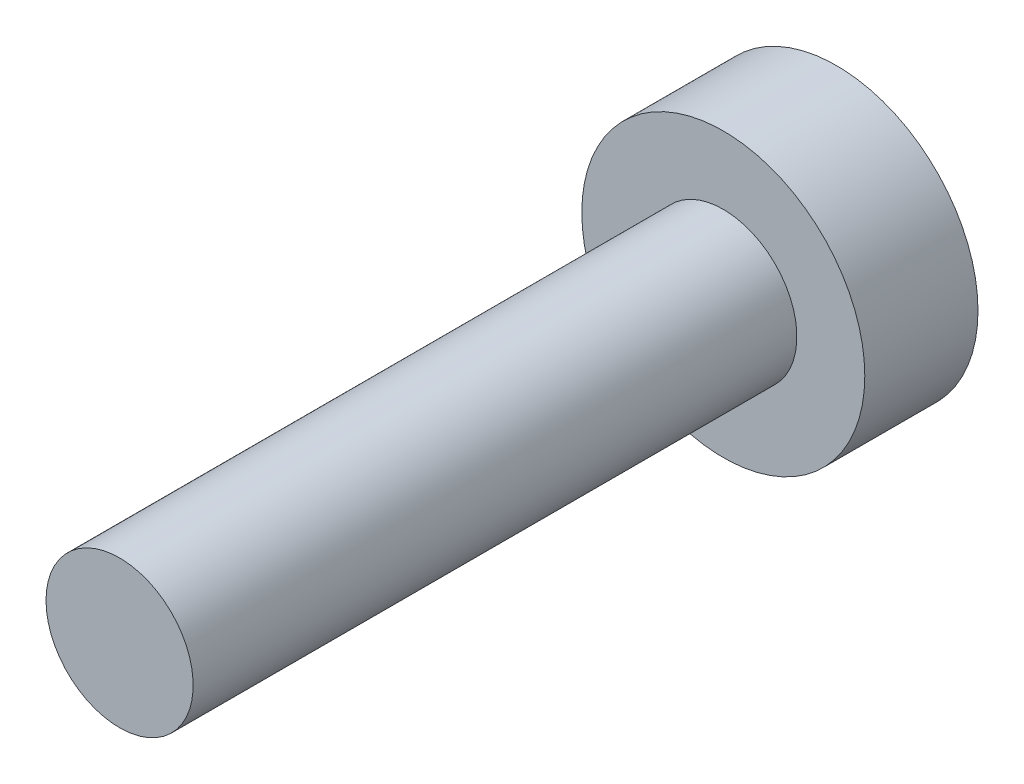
ISO-10303-21;
HEADER;
FILE_DESCRIPTION(('STEP AP214'),'2;1');
FILE_NAME('part.step','',(''),(''),'','','');
FILE_SCHEMA(('AUTOMOTIVE_DESIGN { 1 0 10303 214 1 1 1 1 }'));
ENDSEC;
DATA;
#1=APPLICATION_CONTEXT('core data for automotive mechanical design processes');
#2=APPLICATION_PROTOCOL_DEFINITION('international standard','automotive_design',2000,#1);
#3=PRODUCT_CONTEXT('',#1,'mechanical');
#4=PRODUCT('Part','Part','',(#3));
#5=PRODUCT_RELATED_PRODUCT_CATEGORY('part','',(#4));
#6=PRODUCT_DEFINITION_FORMATION('','',#4);
#7=PRODUCT_DEFINITION_CONTEXT('part definition',#1,'design');
#8=PRODUCT_DEFINITION('design','',#6,#7);
#9=PRODUCT_DEFINITION_SHAPE('','',#8);
#10=(LENGTH_UNIT() NAMED_UNIT(*) SI_UNIT(.MILLI.,.METRE.));
#11=(NAMED_UNIT(*) PLANE_ANGLE_UNIT() SI_UNIT($,.RADIAN.));
#12=(NAMED_UNIT(*) SI_UNIT($,.STERADIAN.) SOLID_ANGLE_UNIT());
#13=UNCERTAINTY_MEASURE_WITH_UNIT(LENGTH_MEASURE(1.E-05),#10,'distance_accuracy_value','');
#14=(GEOMETRIC_REPRESENTATION_CONTEXT(3) GLOBAL_UNCERTAINTY_ASSIGNED_CONTEXT((#13)) GLOBAL_UNIT_ASSIGNED_CONTEXT((#10,
#11,#12)) REPRESENTATION_CONTEXT('',''));
#15=CARTESIAN_POINT('',(0.,0.,0.));
#16=DIRECTION('',(0.,0.,1.));
#17=DIRECTION('',(1.,0.,0.));
#18=AXIS2_PLACEMENT_3D('',#15,#16,#17);
#19=CARTESIAN_POINT('',(-1.11022302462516E-13,-1.64798730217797E-13,16.0000000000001));
#20=DIRECTION('',(0.,0.,-0.99999999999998));
#21=DIRECTION('',(-1.,0.,0.));
#22=AXIS2_PLACEMENT_3D('',#19,#20,#21);
#23=CYLINDRICAL_SURFACE('',#22,1.95);
#24=CARTESIAN_POINT('',(-1.11022302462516E-13,-1.64798730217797E-13,16.0000000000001));
#25=DIRECTION('',(0.,0.,0.99999999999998));
#26=DIRECTION('',(1.,0.,0.));
#27=AXIS2_PLACEMENT_3D('',#24,#25,#26);
#28=CIRCLE('',#27,1.95);
#29=CARTESIAN_POINT('',(-1.95000000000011,-1.65339963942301E-13,16.0000000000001));
#30=VERTEX_POINT('',#29);
#31=EDGE_CURVE('E10',#30,#30,#28,.T.);
#32=CARTESIAN_POINT('',(0.,0.,0.));
#33=DIRECTION('',(0.,0.,0.99999999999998));
#34=DIRECTION('',(1.,0.,0.));
#35=AXIS2_PLACEMENT_3D('',#32,#33,#34);
#36=CIRCLE('',#35,1.95);
#37=CARTESIAN_POINT('',(-1.95000000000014,-1.69665359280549E-13,0.));
#38=VERTEX_POINT('',#37);
#39=EDGE_CURVE('E44',#38,#38,#36,.T.);
#40=CARTESIAN_POINT('',(-1.95000000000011,-1.65339963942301E-13,16.0000000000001));
#41=CARTESIAN_POINT('',(-1.95000000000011,-1.65385020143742E-13,15.8333333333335));
#42=CARTESIAN_POINT('',(-1.95000000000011,-1.65430076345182E-13,15.6666666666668));
#43=CARTESIAN_POINT('',(-1.95000000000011,-1.65520188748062E-13,15.3333333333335));
#44=CARTESIAN_POINT('',(-1.95000000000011,-1.65565244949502E-13,15.1666666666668));
#45=CARTESIAN_POINT('',(-1.95000000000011,-1.65655357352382E-13,14.8333333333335));
#46=CARTESIAN_POINT('',(-1.95000000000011,-1.65700413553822E-13,14.6666666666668));
#47=CARTESIAN_POINT('',(-1.95000000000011,-1.65790525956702E-13,14.3333333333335));
#48=CARTESIAN_POINT('',(-1.95000000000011,-1.65835582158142E-13,14.1666666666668));
#49=CARTESIAN_POINT('',(-1.95000000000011,-1.65925694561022E-13,13.8333333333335));
#50=CARTESIAN_POINT('',(-1.95000000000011,-1.65970750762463E-13,13.6666666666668));
#51=CARTESIAN_POINT('',(-1.95000000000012,-1.66060863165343E-13,13.3333333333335));
#52=CARTESIAN_POINT('',(-1.95000000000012,-1.66105919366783E-13,13.1666666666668));
#53=CARTESIAN_POINT('',(-1.95000000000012,-1.66196031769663E-13,12.8333333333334));
#54=CARTESIAN_POINT('',(-1.95000000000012,-1.66241087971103E-13,12.6666666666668));
#55=CARTESIAN_POINT('',(-1.95000000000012,-1.66331200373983E-13,12.3333333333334));
#56=CARTESIAN_POINT('',(-1.95000000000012,-1.66376256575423E-13,12.1666666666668));
#57=CARTESIAN_POINT('',(-1.95000000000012,-1.66466368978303E-13,11.8333333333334));
#58=CARTESIAN_POINT('',(-1.95000000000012,-1.66511425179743E-13,11.6666666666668));
#59=CARTESIAN_POINT('',(-1.95000000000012,-1.66601537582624E-13,11.3333333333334));
#60=CARTESIAN_POINT('',(-1.95000000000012,-1.66646593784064E-13,11.1666666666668));
#61=CARTESIAN_POINT('',(-1.95000000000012,-1.66736706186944E-13,10.8333333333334));
#62=CARTESIAN_POINT('',(-1.95000000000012,-1.66781762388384E-13,10.6666666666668));
#63=CARTESIAN_POINT('',(-1.95000000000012,-1.66871874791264E-13,10.3333333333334));
#64=CARTESIAN_POINT('',(-1.95000000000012,-1.66916930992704E-13,10.1666666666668));
#65=CARTESIAN_POINT('',(-1.95000000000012,-1.67007043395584E-13,9.83333333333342));
#66=CARTESIAN_POINT('',(-1.95000000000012,-1.67052099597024E-13,9.66666666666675));
#67=CARTESIAN_POINT('',(-1.95000000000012,-1.67142211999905E-13,9.33333333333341));
#68=CARTESIAN_POINT('',(-1.95000000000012,-1.67187268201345E-13,9.16666666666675));
#69=CARTESIAN_POINT('',(-1.95000000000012,-1.67277380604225E-13,8.83333333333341));
#70=CARTESIAN_POINT('',(-1.95000000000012,-1.67322436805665E-13,8.66666666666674));
#71=CARTESIAN_POINT('',(-1.95000000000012,-1.67412549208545E-13,8.33333333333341));
#72=CARTESIAN_POINT('',(-1.95000000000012,-1.67457605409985E-13,8.16666666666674));
#73=CARTESIAN_POINT('',(-1.95000000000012,-1.67547717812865E-13,7.8333333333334));
#74=CARTESIAN_POINT('',(-1.95000000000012,-1.67592774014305E-13,7.66666666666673));
#75=CARTESIAN_POINT('',(-1.95000000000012,-1.67682886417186E-13,7.3333333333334));
#76=CARTESIAN_POINT('',(-1.95000000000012,-1.67727942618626E-13,7.16666666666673));
#77=CARTESIAN_POINT('',(-1.95000000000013,-1.67818055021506E-13,6.83333333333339));
#78=CARTESIAN_POINT('',(-1.95000000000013,-1.67863111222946E-13,6.66666666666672));
#79=CARTESIAN_POINT('',(-1.95000000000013,-1.67953223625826E-13,6.33333333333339));
#80=CARTESIAN_POINT('',(-1.95000000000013,-1.67998279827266E-13,6.16666666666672));
#81=CARTESIAN_POINT('',(-1.95000000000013,-1.68088392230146E-13,5.83333333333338));
#82=CARTESIAN_POINT('',(-1.95000000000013,-1.68133448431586E-13,5.66666666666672));
#83=CARTESIAN_POINT('',(-1.95000000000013,-1.68223560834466E-13,5.33333333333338));
#84=CARTESIAN_POINT('',(-1.95000000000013,-1.68268617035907E-13,5.16666666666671));
#85=CARTESIAN_POINT('',(-1.95000000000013,-1.68358729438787E-13,4.83333333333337));
#86=CARTESIAN_POINT('',(-1.95000000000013,-1.68403785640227E-13,4.66666666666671));
#87=CARTESIAN_POINT('',(-1.95000000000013,-1.68493898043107E-13,4.33333333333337));
#88=CARTESIAN_POINT('',(-1.95000000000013,-1.68538954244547E-13,4.1666666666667));
#89=CARTESIAN_POINT('',(-1.95000000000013,-1.68629066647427E-13,3.83333333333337));
#90=CARTESIAN_POINT('',(-1.95000000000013,-1.68674122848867E-13,3.6666666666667));
#91=CARTESIAN_POINT('',(-1.95000000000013,-1.68764235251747E-13,3.33333333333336));
#92=CARTESIAN_POINT('',(-1.95000000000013,-1.68809291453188E-13,3.16666666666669));
#93=CARTESIAN_POINT('',(-1.95000000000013,-1.68899403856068E-13,2.83333333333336));
#94=CARTESIAN_POINT('',(-1.95000000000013,-1.68944460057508E-13,2.66666666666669));
#95=CARTESIAN_POINT('',(-1.95000000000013,-1.69034572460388E-13,2.33333333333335));
#96=CARTESIAN_POINT('',(-1.95000000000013,-1.69079628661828E-13,2.16666666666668));
#97=CARTESIAN_POINT('',(-1.95000000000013,-1.69169741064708E-13,1.83333333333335));
#98=CARTESIAN_POINT('',(-1.95000000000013,-1.69214797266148E-13,1.66666666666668));
#99=CARTESIAN_POINT('',(-1.95000000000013,-1.69304909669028E-13,1.33333333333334));
#100=CARTESIAN_POINT('',(-1.95000000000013,-1.69349965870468E-13,1.16666666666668));
#101=CARTESIAN_POINT('',(-1.95000000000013,-1.69440078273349E-13,0.83333333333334));
#102=CARTESIAN_POINT('',(-1.95000000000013,-1.69485134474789E-13,0.666666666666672));
#103=CARTESIAN_POINT('',(-1.95000000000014,-1.69575246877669E-13,0.333333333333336));
#104=CARTESIAN_POINT('',(-1.95000000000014,-1.69620303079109E-13,0.166666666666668));
#105=CARTESIAN_POINT('',(-1.95000000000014,-1.69665359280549E-13,0.));
#106=B_SPLINE_CURVE_WITH_KNOTS('',3,(#40,#41,#42,#43,#44,#45,#46,#47,#48,#49,#50,#51,#52,#53,
#54,#55,#56,#57,#58,#59,#60,#61,#62,#63,#64,#65,#66,#67,#68,#69,#70,#71,#72,#73,#74,#75,#76,#77,
#78,#79,#80,#81,#82,#83,#84,#85,#86,#87,#88,#89,#90,#91,#92,#93,#94,#95,#96,#97,#98,#99,#100,
#101,#102,#103,#104,#105),.UNSPECIFIED.,.F.,.F.,(4,2,2,2,2,2,2,2,2,2,2,2,2,2,2,2,2,2,2,2,2,2,2,
2,2,2,2,2,2,2,2,2,4),(0.,0.500000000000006,1.00000000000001,1.50000000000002,2.00000000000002,
2.50000000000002,3.00000000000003,3.50000000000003,4.00000000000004,4.50000000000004,
5.00000000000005,5.50000000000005,6.00000000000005,6.50000000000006,7.00000000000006,
7.50000000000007,8.00000000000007,8.50000000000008,9.00000000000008,9.50000000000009,
10.0000000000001,10.5000000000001,11.0000000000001,11.5000000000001,12.0000000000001,
12.5000000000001,13.0000000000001,13.5000000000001,14.0000000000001,14.5000000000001,
15.0000000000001,15.5000000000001,16.0000000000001),.UNSPECIFIED.);
#107=EDGE_CURVE('BSEAM38',#30,#38,#106,.T.);
#108=ORIENTED_EDGE('',*,*,#31,.F.);
#109=ORIENTED_EDGE('',*,*,#39,.T.);
#110=ORIENTED_EDGE('',*,*,#107,.T.);
#111=ORIENTED_EDGE('',*,*,#107,.F.);
#112=EDGE_LOOP('',(#108,#110,#109,#111));
#113=FACE_BOUND('',#112,.T.);
#114=ADVANCED_FACE('F38',(#113),#23,.T.);
#115=CARTESIAN_POINT('',(-1.11022302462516E-13,-1.64798730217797E-13,16.0000000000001));
#116=DIRECTION('',(0.,0.,0.99999999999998));
#117=DIRECTION('',(1.,0.,0.));
#118=AXIS2_PLACEMENT_3D('',#115,#116,#117);
#119=PLANE('',#118);
#120=ORIENTED_EDGE('',*,*,#31,.T.);
#121=EDGE_LOOP('',(#120));
#122=FACE_BOUND('',#121,.T.);
#123=ADVANCED_FACE('F71',(#122),#119,.T.);
#124=CARTESIAN_POINT('',(-1.07552855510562E-13,-1.64798730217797E-13,-2.99999999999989));
#125=DIRECTION('',(0.,0.,0.99999999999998));
#126=DIRECTION('',(1.,0.,0.));
#127=AXIS2_PLACEMENT_3D('',#124,#125,#126);
#128=CYLINDRICAL_SURFACE('',#127,3.75);
#129=CARTESIAN_POINT('',(-1.07552855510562E-13,-1.64798730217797E-13,-2.99999999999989));
#130=DIRECTION('',(0.,0.,-0.99999999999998));
#131=DIRECTION('',(-1.,0.,0.));
#132=AXIS2_PLACEMENT_3D('',#129,#130,#131);
#133=CIRCLE('',#132,3.75);
#134=CARTESIAN_POINT('',(3.74999999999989,-1.63757896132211E-13,-2.9999999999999));
#135=VERTEX_POINT('',#134);
#136=EDGE_CURVE('E48',#135,#135,#133,.T.);
#137=CARTESIAN_POINT('',(0.,0.,0.));
#138=DIRECTION('',(0.,0.,-0.99999999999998));
#139=DIRECTION('',(-1.,0.,0.));
#140=AXIS2_PLACEMENT_3D('',#137,#138,#139);
#141=CIRCLE('',#140,3.75);
#142=CARTESIAN_POINT('',(3.7499999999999,-1.62946884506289E-13,0.));
#143=VERTEX_POINT('',#142);
#144=EDGE_CURVE('E52',#143,#143,#141,.T.);
#145=CARTESIAN_POINT('',(3.74999999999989,-1.63757896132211E-13,-2.9999999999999));
#146=CARTESIAN_POINT('',(3.74999999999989,-1.63749448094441E-13,-2.9687499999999));
#147=CARTESIAN_POINT('',(3.74999999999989,-1.63741000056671E-13,-2.9374999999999));
#148=CARTESIAN_POINT('',(3.74999999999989,-1.63724103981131E-13,-2.8749999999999));
#149=CARTESIAN_POINT('',(3.74999999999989,-1.63715655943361E-13,-2.8437499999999));
#150=CARTESIAN_POINT('',(3.74999999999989,-1.6369875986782E-13,-2.78124999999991));
#151=CARTESIAN_POINT('',(3.74999999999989,-1.6369031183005E-13,-2.74999999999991));
#152=CARTESIAN_POINT('',(3.74999999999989,-1.6367341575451E-13,-2.68749999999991));
#153=CARTESIAN_POINT('',(3.74999999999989,-1.6366496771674E-13,-2.65624999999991));
#154=CARTESIAN_POINT('',(3.74999999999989,-1.636480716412E-13,-2.59374999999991));
#155=CARTESIAN_POINT('',(3.74999999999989,-1.6363962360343E-13,-2.56249999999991));
#156=CARTESIAN_POINT('',(3.74999999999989,-1.6362272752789E-13,-2.49999999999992));
#157=CARTESIAN_POINT('',(3.74999999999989,-1.6361427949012E-13,-2.46874999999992));
#158=CARTESIAN_POINT('',(3.74999999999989,-1.6359738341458E-13,-2.40624999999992));
#159=CARTESIAN_POINT('',(3.74999999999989,-1.6358893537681E-13,-2.37499999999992));
#160=CARTESIAN_POINT('',(3.74999999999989,-1.6357203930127E-13,-2.31249999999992));
#161=CARTESIAN_POINT('',(3.7499999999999,-1.635635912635E-13,-2.28124999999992));
#162=CARTESIAN_POINT('',(3.7499999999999,-1.6354669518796E-13,-2.21874999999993));
#163=CARTESIAN_POINT('',(3.7499999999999,-1.6353824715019E-13,-2.18749999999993));
#164=CARTESIAN_POINT('',(3.7499999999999,-1.6352135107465E-13,-2.12499999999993));
#165=CARTESIAN_POINT('',(3.7499999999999,-1.6351290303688E-13,-2.09374999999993));
#166=CARTESIAN_POINT('',(3.7499999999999,-1.6349600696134E-13,-2.03124999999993));
#167=CARTESIAN_POINT('',(3.7499999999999,-1.6348755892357E-13,-1.99999999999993));
#168=CARTESIAN_POINT('',(3.7499999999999,-1.6347066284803E-13,-1.93749999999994));
#169=CARTESIAN_POINT('',(3.7499999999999,-1.6346221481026E-13,-1.90624999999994));
#170=CARTESIAN_POINT('',(3.7499999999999,-1.6344531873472E-13,-1.84374999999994));
#171=CARTESIAN_POINT('',(3.7499999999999,-1.6343687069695E-13,-1.81249999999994));
#172=CARTESIAN_POINT('',(3.7499999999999,-1.6341997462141E-13,-1.74999999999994));
#173=CARTESIAN_POINT('',(3.7499999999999,-1.6341152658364E-13,-1.71874999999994));
#174=CARTESIAN_POINT('',(3.7499999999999,-1.633946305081E-13,-1.65624999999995));
#175=CARTESIAN_POINT('',(3.7499999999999,-1.6338618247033E-13,-1.62499999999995));
#176=CARTESIAN_POINT('',(3.7499999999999,-1.6336928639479E-13,-1.56249999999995));
#177=CARTESIAN_POINT('',(3.7499999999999,-1.6336083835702E-13,-1.53124999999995));
#178=CARTESIAN_POINT('',(3.7499999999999,-1.6334394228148E-13,-1.46874999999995));
#179=CARTESIAN_POINT('',(3.7499999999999,-1.6333549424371E-13,-1.43749999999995));
#180=CARTESIAN_POINT('',(3.7499999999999,-1.6331859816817E-13,-1.37499999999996));
#181=CARTESIAN_POINT('',(3.7499999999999,-1.633101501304E-13,-1.34374999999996));
#182=CARTESIAN_POINT('',(3.7499999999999,-1.6329325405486E-13,-1.28124999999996));
#183=CARTESIAN_POINT('',(3.7499999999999,-1.6328480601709E-13,-1.24999999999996));
#184=CARTESIAN_POINT('',(3.7499999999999,-1.6326790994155E-13,-1.18749999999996));
#185=CARTESIAN_POINT('',(3.7499999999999,-1.6325946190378E-13,-1.15624999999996));
#186=CARTESIAN_POINT('',(3.7499999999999,-1.6324256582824E-13,-1.09374999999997));
#187=CARTESIAN_POINT('',(3.7499999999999,-1.6323411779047E-13,-1.06249999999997));
#188=CARTESIAN_POINT('',(3.7499999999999,-1.6321722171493E-13,-0.999999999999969));
#189=CARTESIAN_POINT('',(3.7499999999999,-1.6320877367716E-13,-0.968749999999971));
#190=CARTESIAN_POINT('',(3.7499999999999,-1.6319187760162E-13,-0.906249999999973));
#191=CARTESIAN_POINT('',(3.7499999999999,-1.6318342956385E-13,-0.874999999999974));
#192=CARTESIAN_POINT('',(3.7499999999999,-1.6316653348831E-13,-0.812499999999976));
#193=CARTESIAN_POINT('',(3.7499999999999,-1.6315808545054E-13,-0.781249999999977));
#194=CARTESIAN_POINT('',(3.7499999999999,-1.63141189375E-13,-0.71874999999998));
#195=CARTESIAN_POINT('',(3.7499999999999,-1.63132741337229E-13,-0.687499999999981));
#196=CARTESIAN_POINT('',(3.7499999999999,-1.63115845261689E-13,-0.624999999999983));
#197=CARTESIAN_POINT('',(3.7499999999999,-1.63107397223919E-13,-0.593749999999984));
#198=CARTESIAN_POINT('',(3.7499999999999,-1.63090501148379E-13,-0.531249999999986));
#199=CARTESIAN_POINT('',(3.7499999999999,-1.63082053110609E-13,-0.499999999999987));
#200=CARTESIAN_POINT('',(3.7499999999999,-1.63065157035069E-13,-0.43749999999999));
#201=CARTESIAN_POINT('',(3.7499999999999,-1.63056708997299E-13,-0.406249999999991));
#202=CARTESIAN_POINT('',(3.7499999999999,-1.63039812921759E-13,-0.343749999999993));
#203=CARTESIAN_POINT('',(3.7499999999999,-1.63031364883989E-13,-0.312499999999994));
#204=CARTESIAN_POINT('',(3.7499999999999,-1.63014468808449E-13,-0.249999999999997));
#205=CARTESIAN_POINT('',(3.7499999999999,-1.63006020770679E-13,-0.218749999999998));
#206=CARTESIAN_POINT('',(3.7499999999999,-1.62989124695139E-13,-0.15625));
#207=CARTESIAN_POINT('',(3.7499999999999,-1.62980676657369E-13,-0.125000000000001));
#208=CARTESIAN_POINT('',(3.7499999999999,-1.62963780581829E-13,-0.0625000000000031));
#209=CARTESIAN_POINT('',(3.7499999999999,-1.62955332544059E-13,-0.0312500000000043));
#210=CARTESIAN_POINT('',(3.7499999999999,-1.62946884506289E-13,0.));
#211=B_SPLINE_CURVE_WITH_KNOTS('',3,(#145,#146,#147,#148,#149,#150,#151,#152,#153,#154,#155,
#156,#157,#158,#159,#160,#161,#162,#163,#164,#165,#166,#167,#168,#169,#170,#171,#172,#173,#174,
#175,#176,#177,#178,#179,#180,#181,#182,#183,#184,#185,#186,#187,#188,#189,#190,#191,#192,#193,
#194,#195,#196,#197,#198,#199,#200,#201,#202,#203,#204,#205,#206,#207,#208,#209,#210),
.UNSPECIFIED.,.F.,.F.,(4,2,2,2,2,2,2,2,2,2,2,2,2,2,2,2,2,2,2,2,2,2,2,2,2,2,2,2,2,2,2,2,4),(0.,
0.0937499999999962,0.187499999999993,0.281249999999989,0.374999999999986,0.468749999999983,
0.562499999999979,0.656249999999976,0.749999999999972,0.843749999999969,0.937499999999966,
1.03124999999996,1.12499999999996,1.21874999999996,1.31249999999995,1.40624999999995,
1.49999999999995,1.59374999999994,1.68749999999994,1.78124999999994,1.87499999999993,
1.96874999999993,2.06249999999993,2.15624999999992,2.24999999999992,2.34374999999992,
2.43749999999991,2.53124999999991,2.6249999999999,2.7187499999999,2.8124999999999,
2.9062499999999,2.99999999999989),.UNSPECIFIED.);
#212=EDGE_CURVE('BSEAM58',#135,#143,#211,.T.);
#213=ORIENTED_EDGE('',*,*,#136,.F.);
#214=ORIENTED_EDGE('',*,*,#144,.T.);
#215=ORIENTED_EDGE('',*,*,#212,.T.);
#216=ORIENTED_EDGE('',*,*,#212,.F.);
#217=EDGE_LOOP('',(#213,#215,#214,#216));
#218=FACE_BOUND('',#217,.T.);
#219=ADVANCED_FACE('F58',(#218),#128,.T.);
#220=CARTESIAN_POINT('',(-1.07552855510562E-13,-1.64798730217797E-13,-2.99999999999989));
#221=DIRECTION('',(0.,0.,-0.99999999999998));
#222=DIRECTION('',(-1.,0.,0.));
#223=AXIS2_PLACEMENT_3D('',#220,#221,#222);
#224=PLANE('',#223);
#225=ORIENTED_EDGE('',*,*,#136,.T.);
#226=EDGE_LOOP('',(#225));
#227=FACE_BOUND('',#226,.T.);
#228=ADVANCED_FACE('F62',(#227),#224,.T.);
#229=CARTESIAN_POINT('',(0.,0.,0.));
#230=DIRECTION('',(0.,0.,-0.99999999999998));
#231=DIRECTION('',(-1.,0.,0.));
#232=AXIS2_PLACEMENT_3D('',#229,#230,#231);
#233=PLANE('',#232);
#234=ORIENTED_EDGE('',*,*,#39,.F.);
#235=EDGE_LOOP('',(#234));
#236=FACE_BOUND('',#235,.T.);
#237=ORIENTED_EDGE('',*,*,#144,.F.);
#238=EDGE_LOOP('',(#237));
#239=FACE_BOUND('',#238,.T.);
#240=ADVANCED_FACE('F60',(#236,#239),#233,.F.);
#241=CLOSED_SHELL('',(#114,#123,#219,#228,#240));
#242=MANIFOLD_SOLID_BREP('B2',#241);
#243=ADVANCED_BREP_SHAPE_REPRESENTATION('',(#18,#242),#14);
#244=SHAPE_DEFINITION_REPRESENTATION(#9,#243);
ENDSEC;
END-ISO-10303-21;
